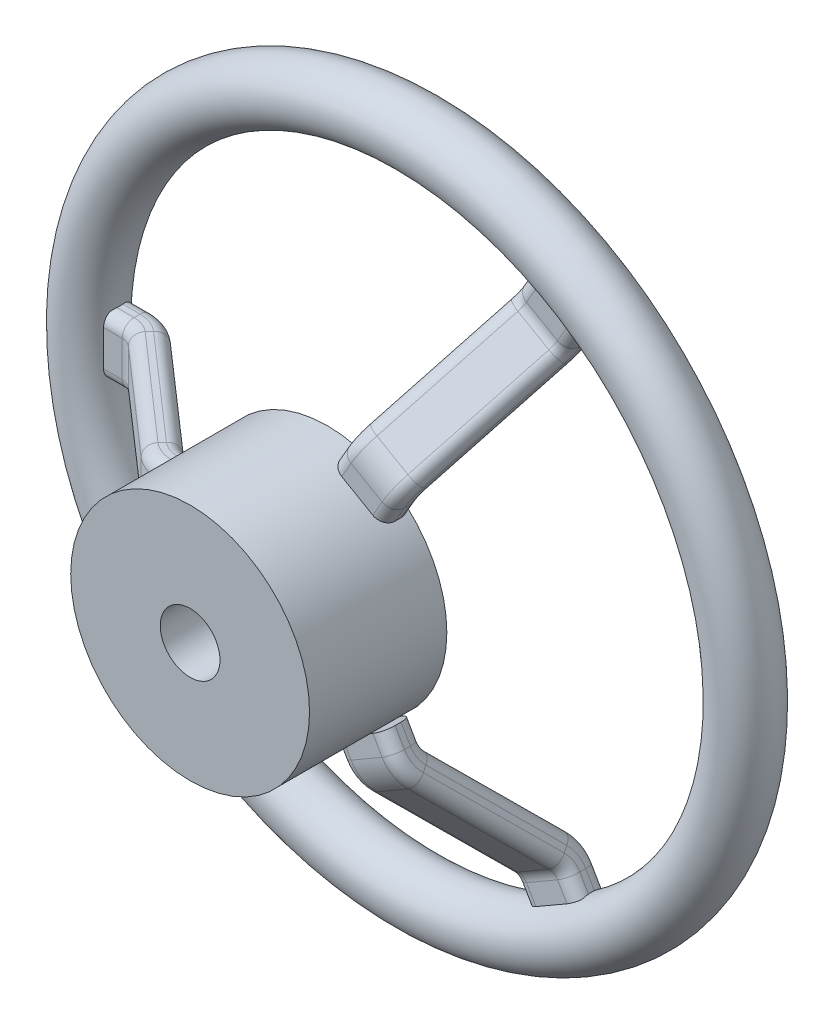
from build123d import *

# Parameters (mm, degrees)
SKETCH_1_R               = 20
SKETCH_1_R_2             = 5
EXTRUDE_1_DEPTH          = 23
SKETCH_5_R               = 5
EXTRUDE_4_REACH          = 104.611
EXTRUDE_4_END_RADIUS     = 20
PATTERN_CIRCULAR_8_COUNT = 3


with BuildPart() as part:
    # Sketch 1 → Extrude 1 (new body)
    with BuildSketch(Plane.XY):
        Circle(SKETCH_1_R)
        Circle(SKETCH_1_R_2, mode=Mode.SUBTRACT)
    extrude(amount=EXTRUDE_1_DEPTH)


with BuildPart() as body_2:
    # Sweep 1: sweep along a path in Sketch 4
    with BuildLine(Plane(origin=(0, 0, -15), x_dir=(-1, 0, 0), z_dir=(0, 0, -1))) as sweep_1_path:
        CenterArc((0, 0), 55, 0, 360)
    # Sketch 5 → Sweep 1 (sweep)
    with BuildSketch(Plane(origin=(0, 0, 0), x_dir=(0, 0, -1), z_dir=(1, 0, 0))):
        with Locations((15, 55)):
            Circle(SKETCH_5_R)
    sweep(path=sweep_1_path.line)


with BuildPart() as body_3:
    # Sweep 7: sweep along a path in Sketch 8
    with BuildLine(Plane(origin=(0, 0, 0), x_dir=(1, 0, 0), z_dir=(0, 1, 0))) as sweep_7_path:
        Line((-50, 15), (-46.878675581, 15))
        ThreePointArc((-46.878675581, 15), (-45.120042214, 14.68051372), (-43.586152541, 13.762883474))
        Line((-43.586152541, 13.762883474), (-26.413847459, -1.262883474))
        ThreePointArc((-26.413847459, -1.262883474), (-24.879957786, -2.18051372), (-23.121324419, -2.5))
        Line((-23.121324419, -2.5), (-20, -2.5))
    # Sketch 10 → Sweep 7 (sweep)
    with BuildSketch(Plane(origin=(-20, 0, 0), x_dir=(0, 0, -1), z_dir=(1, 0, 0))):
        with BuildLine():
            Line((-2, 5), (-3, 5))
            ThreePointArc((-3, 5), (-4.414213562, 4.414213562), (-5, 3))
            Line((-5, 3), (-5, -3))
            ThreePointArc((-5, -3), (-4.414213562, -4.414213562), (-3, -5))
            Line((-3, -5), (-2, -5))
            ThreePointArc((-2, -5), (-0.585786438, -4.414213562), (0, -3))
            Line((0, -3), (0, 3))
            ThreePointArc((0, 3), (-0.585786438, 4.414213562), (-2, 5))
        make_face()
    sweep(path=sweep_7_path.line)


with BuildPart() as body_4:
    # Extrude 4: up to this cylinder (the profile starts outside it)
    extrude_4_end = Plane(origin=(0, 0, 2.5), z_dir=(0, 0, -1)) * Cylinder(EXTRUDE_4_END_RADIUS, 250.222, mode=Mode.PRIVATE)
    # Sketch 11 → Extrude 4 (new, up to the surface)
    with BuildSketch(Plane(origin=(-20, 0, 0), x_dir=(0, 0, -1), z_dir=(1, 0, 0)), mode=Mode.PRIVATE) as extrude_4_sk1:
        with BuildLine():
            Line((0, -3), (0, 3))
            ThreePointArc((0, 3), (-0.585786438, 4.414213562), (-2, 5))
            Line((-2, 5), (-3, 5))
            ThreePointArc((-3, 5), (-4.414213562, 4.414213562), (-5, 3))
            Line((-5, 3), (-5, -3))
            ThreePointArc((-5, -3), (-4.414213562, -4.414213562), (-3, -5))
            Line((-3, -5), (-2, -5))
            ThreePointArc((-2, -5), (-0.585786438, -4.414213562), (0, -3))
        make_face()
    extrude_4_tool1 = extrude(extrude_4_sk1.sketch, amount=EXTRUDE_4_REACH, mode=Mode.PRIVATE) - extrude_4_end
    add(extrude_4_tool1.solids().sort_by_distance((-20, 0, 2.5))[0])
    add(extrude_4_tool1.solids().sort_by_distance((-20, 0, 2.5))[1])


with BuildPart() as pattern_circular_8_1:
    # Pattern Circular 8: pattern copy
    add(body_3.part.rotate(Axis((0, 0, 0), (0, 0, 1)), 1 * 360 / PATTERN_CIRCULAR_8_COUNT))


with BuildPart() as pattern_circular_8_2:
    # Pattern Circular 8: pattern copy
    add(body_3.part.rotate(Axis((0, 0, 0), (0, 0, 1)), 2 * 360 / PATTERN_CIRCULAR_8_COUNT))


solid = Compound([part.part, body_2.part, body_3.part, body_4.part, pattern_circular_8_1.part, pattern_circular_8_2.part])
